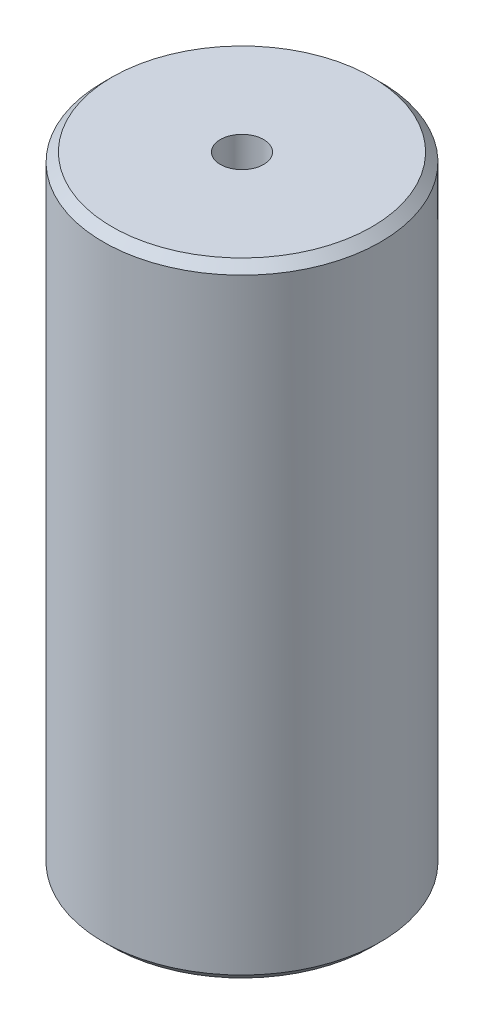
ISO-10303-21;
HEADER;
FILE_DESCRIPTION(('STEP AP214'),'2;1');
FILE_NAME('part.step','',(''),(''),'','','');
FILE_SCHEMA(('AUTOMOTIVE_DESIGN { 1 0 10303 214 1 1 1 1 }'));
ENDSEC;
DATA;
#1=APPLICATION_CONTEXT('core data for automotive mechanical design processes');
#2=APPLICATION_PROTOCOL_DEFINITION('international standard','automotive_design',2000,#1);
#3=PRODUCT_CONTEXT('',#1,'mechanical');
#4=PRODUCT('Part','Part','',(#3));
#5=PRODUCT_RELATED_PRODUCT_CATEGORY('part','',(#4));
#6=PRODUCT_DEFINITION_FORMATION('','',#4);
#7=PRODUCT_DEFINITION_CONTEXT('part definition',#1,'design');
#8=PRODUCT_DEFINITION('design','',#6,#7);
#9=PRODUCT_DEFINITION_SHAPE('','',#8);
#10=(LENGTH_UNIT() NAMED_UNIT(*) SI_UNIT(.MILLI.,.METRE.));
#11=(NAMED_UNIT(*) PLANE_ANGLE_UNIT() SI_UNIT($,.RADIAN.));
#12=(NAMED_UNIT(*) SI_UNIT($,.STERADIAN.) SOLID_ANGLE_UNIT());
#13=UNCERTAINTY_MEASURE_WITH_UNIT(LENGTH_MEASURE(1.E-05),#10,'distance_accuracy_value','');
#14=(GEOMETRIC_REPRESENTATION_CONTEXT(3) GLOBAL_UNCERTAINTY_ASSIGNED_CONTEXT((#13)) GLOBAL_UNIT_ASSIGNED_CONTEXT((#10,
#11,#12)) REPRESENTATION_CONTEXT('',''));
#15=CARTESIAN_POINT('',(0.,0.,0.));
#16=DIRECTION('',(0.,0.,1.));
#17=DIRECTION('',(1.,0.,0.));
#18=AXIS2_PLACEMENT_3D('',#15,#16,#17);
#19=CARTESIAN_POINT('',(0.,114.3,0.));
#20=DIRECTION('',(0.,-1.,0.));
#21=DIRECTION('',(1.,0.,0.));
#22=AXIS2_PLACEMENT_3D('',#19,#20,#21);
#23=PLANE('',#22);
#24=CARTESIAN_POINT('',(0.,114.3,0.));
#25=DIRECTION('',(0.,1.,0.));
#26=DIRECTION('',(0.,0.,1.));
#27=AXIS2_PLACEMENT_3D('',#24,#25,#26);
#28=CIRCLE('',#27,3.96874999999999);
#29=CARTESIAN_POINT('',(0.,114.3,3.96874999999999));
#30=VERTEX_POINT('',#29);
#31=EDGE_CURVE('E61',#30,#30,#28,.T.);
#32=ORIENTED_EDGE('',*,*,#31,.F.);
#33=EDGE_LOOP('',(#32));
#34=FACE_BOUND('',#33,.T.);
#35=CARTESIAN_POINT('',(0.,114.3,0.));
#36=DIRECTION('',(0.,-1.,0.));
#37=DIRECTION('',(1.,0.,0.));
#38=AXIS2_PLACEMENT_3D('',#35,#36,#37);
#39=CIRCLE('',#38,23.7998);
#40=CARTESIAN_POINT('',(23.7998,114.3,0.));
#41=VERTEX_POINT('',#40);
#42=EDGE_CURVE('E11',#41,#41,#39,.F.);
#43=ORIENTED_EDGE('',*,*,#42,.T.);
#44=EDGE_LOOP('',(#43));
#45=FACE_BOUND('',#44,.T.);
#46=ADVANCED_FACE('F36',(#34,#45),#23,.F.);
#47=CARTESIAN_POINT('',(0.,114.3,0.));
#48=DIRECTION('',(0.,1.,0.));
#49=DIRECTION('',(-1.,0.,0.));
#50=AXIS2_PLACEMENT_3D('',#47,#48,#49);
#51=CYLINDRICAL_SURFACE('',#50,25.4);
#52=CARTESIAN_POINT('',(0.,1.60019999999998,0.));
#53=DIRECTION('',(0.,1.,0.));
#54=DIRECTION('',(-1.,0.,0.));
#55=AXIS2_PLACEMENT_3D('',#52,#53,#54);
#56=CIRCLE('',#55,25.4);
#57=CARTESIAN_POINT('',(-25.4,1.60019999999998,0.));
#58=VERTEX_POINT('',#57);
#59=EDGE_CURVE('E74',#58,#58,#56,.T.);
#60=ORIENTED_EDGE('',*,*,#59,.T.);
#61=EDGE_LOOP('',(#60));
#62=FACE_BOUND('',#61,.T.);
#63=CARTESIAN_POINT('',(0.,112.6998,0.));
#64=DIRECTION('',(0.,-1.,0.));
#65=DIRECTION('',(1.,0.,0.));
#66=AXIS2_PLACEMENT_3D('',#63,#64,#65);
#67=CIRCLE('',#66,25.4);
#68=CARTESIAN_POINT('',(25.4,112.6998,0.));
#69=VERTEX_POINT('',#68);
#70=EDGE_CURVE('E71',#69,#69,#67,.T.);
#71=ORIENTED_EDGE('',*,*,#70,.T.);
#72=EDGE_LOOP('',(#71));
#73=FACE_BOUND('',#72,.T.);
#74=ADVANCED_FACE('F86',(#62,#73),#51,.T.);
#75=CARTESIAN_POINT('',(0.,0.,0.));
#76=DIRECTION('',(0.,1.,0.));
#77=DIRECTION('',(-1.,0.,0.));
#78=AXIS2_PLACEMENT_3D('',#75,#76,#77);
#79=PLANE('',#78);
#80=CARTESIAN_POINT('',(0.,0.,0.));
#81=DIRECTION('',(0.,-1.,0.));
#82=DIRECTION('',(0.,0.,-1.));
#83=AXIS2_PLACEMENT_3D('',#80,#81,#82);
#84=CIRCLE('',#83,3.96874999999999);
#85=CARTESIAN_POINT('',(0.,0.,-3.96874999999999));
#86=VERTEX_POINT('',#85);
#87=EDGE_CURVE('E60',#86,#86,#84,.T.);
#88=ORIENTED_EDGE('',*,*,#87,.F.);
#89=EDGE_LOOP('',(#88));
#90=FACE_BOUND('',#89,.T.);
#91=CARTESIAN_POINT('',(0.,0.,0.));
#92=DIRECTION('',(0.,1.,0.));
#93=DIRECTION('',(-1.,0.,0.));
#94=AXIS2_PLACEMENT_3D('',#91,#92,#93);
#95=CIRCLE('',#94,23.7998);
#96=CARTESIAN_POINT('',(-23.7998,0.,0.));
#97=VERTEX_POINT('',#96);
#98=EDGE_CURVE('E44',#97,#97,#95,.F.);
#99=ORIENTED_EDGE('',*,*,#98,.T.);
#100=EDGE_LOOP('',(#99));
#101=FACE_BOUND('',#100,.T.);
#102=ADVANCED_FACE('F79',(#90,#101),#79,.F.);
#103=CARTESIAN_POINT('',(0.,1.60019999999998,0.));
#104=DIRECTION('',(0.,1.,0.));
#105=DIRECTION('',(-1.,0.,0.));
#106=AXIS2_PLACEMENT_3D('',#103,#104,#105);
#107=CONICAL_SURFACE('',#106,25.4,0.785398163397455);
#108=ORIENTED_EDGE('',*,*,#98,.F.);
#109=EDGE_LOOP('',(#108));
#110=FACE_BOUND('',#109,.T.);
#111=ORIENTED_EDGE('',*,*,#59,.F.);
#112=EDGE_LOOP('',(#111));
#113=FACE_BOUND('',#112,.T.);
#114=ADVANCED_FACE('F81',(#110,#113),#107,.T.);
#115=CARTESIAN_POINT('',(0.,114.3,0.));
#116=DIRECTION('',(0.,-1.,0.));
#117=DIRECTION('',(1.,0.,0.));
#118=AXIS2_PLACEMENT_3D('',#115,#116,#117);
#119=CONICAL_SURFACE('',#118,23.7998,0.785398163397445);
#120=CARTESIAN_POINT('',(25.4,112.6998,0.));
#121=CARTESIAN_POINT('',(25.38333125,112.71646875,0.));
#122=CARTESIAN_POINT('',(25.3666625,112.7331375,0.));
#123=CARTESIAN_POINT('',(25.333325,112.766475,0.));
#124=CARTESIAN_POINT('',(25.31665625,112.78314375,0.));
#125=CARTESIAN_POINT('',(25.28331875,112.81648125,0.));
#126=CARTESIAN_POINT('',(25.26665,112.83315,0.));
#127=CARTESIAN_POINT('',(25.2333125,112.8664875,0.));
#128=CARTESIAN_POINT('',(25.21664375,112.88315625,0.));
#129=CARTESIAN_POINT('',(25.18330625,112.91649375,0.));
#130=CARTESIAN_POINT('',(25.1666375,112.9331625,0.));
#131=CARTESIAN_POINT('',(25.1333,112.9665,0.));
#132=CARTESIAN_POINT('',(25.11663125,112.98316875,0.));
#133=CARTESIAN_POINT('',(25.08329375,113.01650625,0.));
#134=CARTESIAN_POINT('',(25.066625,113.033175,0.));
#135=CARTESIAN_POINT('',(25.0332875,113.0665125,0.));
#136=CARTESIAN_POINT('',(25.01661875,113.08318125,0.));
#137=CARTESIAN_POINT('',(24.98328125,113.11651875,0.));
#138=CARTESIAN_POINT('',(24.9666125,113.1331875,0.));
#139=CARTESIAN_POINT('',(24.933275,113.166525,0.));
#140=CARTESIAN_POINT('',(24.91660625,113.18319375,0.));
#141=CARTESIAN_POINT('',(24.88326875,113.21653125,0.));
#142=CARTESIAN_POINT('',(24.8666,113.2332,0.));
#143=CARTESIAN_POINT('',(24.8332625,113.2665375,0.));
#144=CARTESIAN_POINT('',(24.81659375,113.28320625,0.));
#145=CARTESIAN_POINT('',(24.78325625,113.31654375,0.));
#146=CARTESIAN_POINT('',(24.7665875,113.3332125,0.));
#147=CARTESIAN_POINT('',(24.73325,113.36655,0.));
#148=CARTESIAN_POINT('',(24.71658125,113.38321875,0.));
#149=CARTESIAN_POINT('',(24.68324375,113.41655625,0.));
#150=CARTESIAN_POINT('',(24.666575,113.433225,0.));
#151=CARTESIAN_POINT('',(24.6332375,113.4665625,0.));
#152=CARTESIAN_POINT('',(24.61656875,113.48323125,0.));
#153=CARTESIAN_POINT('',(24.58323125,113.51656875,0.));
#154=CARTESIAN_POINT('',(24.5665625,113.5332375,0.));
#155=CARTESIAN_POINT('',(24.533225,113.566575,0.));
#156=CARTESIAN_POINT('',(24.51655625,113.58324375,0.));
#157=CARTESIAN_POINT('',(24.48321875,113.61658125,0.));
#158=CARTESIAN_POINT('',(24.46655,113.63325,0.));
#159=CARTESIAN_POINT('',(24.4332125,113.6665875,0.));
#160=CARTESIAN_POINT('',(24.41654375,113.68325625,0.));
#161=CARTESIAN_POINT('',(24.38320625,113.71659375,0.));
#162=CARTESIAN_POINT('',(24.3665375,113.7332625,0.));
#163=CARTESIAN_POINT('',(24.3332,113.7666,0.));
#164=CARTESIAN_POINT('',(24.31653125,113.78326875,0.));
#165=CARTESIAN_POINT('',(24.28319375,113.81660625,0.));
#166=CARTESIAN_POINT('',(24.266525,113.833275,0.));
#167=CARTESIAN_POINT('',(24.2331875,113.8666125,0.));
#168=CARTESIAN_POINT('',(24.21651875,113.88328125,0.));
#169=CARTESIAN_POINT('',(24.18318125,113.91661875,0.));
#170=CARTESIAN_POINT('',(24.1665125,113.9332875,0.));
#171=CARTESIAN_POINT('',(24.133175,113.966625,0.));
#172=CARTESIAN_POINT('',(24.11650625,113.98329375,0.));
#173=CARTESIAN_POINT('',(24.08316875,114.01663125,0.));
#174=CARTESIAN_POINT('',(24.0665,114.0333,0.));
#175=CARTESIAN_POINT('',(24.0331625,114.0666375,0.));
#176=CARTESIAN_POINT('',(24.01649375,114.08330625,0.));
#177=CARTESIAN_POINT('',(23.98315625,114.11664375,0.));
#178=CARTESIAN_POINT('',(23.9664875,114.1333125,0.));
#179=CARTESIAN_POINT('',(23.93315,114.16665,0.));
#180=CARTESIAN_POINT('',(23.91648125,114.18331875,0.));
#181=CARTESIAN_POINT('',(23.88314375,114.21665625,0.));
#182=CARTESIAN_POINT('',(23.866475,114.233325,0.));
#183=CARTESIAN_POINT('',(23.8331375,114.2666625,0.));
#184=CARTESIAN_POINT('',(23.81646875,114.28333125,0.));
#185=CARTESIAN_POINT('',(23.7998,114.3,0.));
#186=B_SPLINE_CURVE_WITH_KNOTS('',3,(#120,#121,#122,#123,#124,#125,#126,#127,#128,#129,#130,
#131,#132,#133,#134,#135,#136,#137,#138,#139,#140,#141,#142,#143,#144,#145,#146,#147,#148,#149,
#150,#151,#152,#153,#154,#155,#156,#157,#158,#159,#160,#161,#162,#163,#164,#165,#166,#167,#168,
#169,#170,#171,#172,#173,#174,#175,#176,#177,#178,#179,#180,#181,#182,#183,#184,#185),
.UNSPECIFIED.,.F.,.F.,(4,2,2,2,2,2,2,2,2,2,2,2,2,2,2,2,2,2,2,2,2,2,2,2,2,2,2,2,2,2,2,2,4),(0.,
0.0707195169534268,0.141439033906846,0.212158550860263,0.28287806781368,0.3535975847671,
0.424317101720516,0.495036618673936,0.565756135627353,0.63647565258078,0.707195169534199,
0.777914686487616,0.848634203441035,0.919353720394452,0.990073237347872,1.06079275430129,
1.13151227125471,1.20223178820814,1.27295130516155,1.34367082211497,1.41439033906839,
1.48510985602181,1.55582937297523,1.62654888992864,1.69726840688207,1.76798792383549,
1.83870744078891,1.90942695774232,1.98014647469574,2.05086599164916,2.12158550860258,
2.192305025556,2.26302454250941),.UNSPECIFIED.);
#187=EDGE_CURVE('BSEAM38',#69,#41,#186,.T.);
#188=ORIENTED_EDGE('',*,*,#70,.F.);
#189=ORIENTED_EDGE('',*,*,#42,.F.);
#190=ORIENTED_EDGE('',*,*,#187,.T.);
#191=ORIENTED_EDGE('',*,*,#187,.F.);
#192=EDGE_LOOP('',(#188,#190,#189,#191));
#193=FACE_BOUND('',#192,.T.);
#194=ADVANCED_FACE('F38',(#193),#119,.T.);
#195=CARTESIAN_POINT('',(0.,20.6375,0.));
#196=DIRECTION('',(0.,-1.,0.));
#197=DIRECTION('',(0.,0.,-1.));
#198=AXIS2_PLACEMENT_3D('',#195,#196,#197);
#199=CONICAL_SURFACE('',#198,3.96874999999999,1.02974425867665);
#200=CARTESIAN_POINT('',(0.,23.0221655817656,0.));
#201=VERTEX_POINT('',#200);
#202=VERTEX_LOOP('',#201);
#203=FACE_BOUND('',#202,.T.);
#204=CARTESIAN_POINT('',(0.,20.6375,0.));
#205=DIRECTION('',(0.,-1.,0.));
#206=DIRECTION('',(0.,0.,-1.));
#207=AXIS2_PLACEMENT_3D('',#204,#205,#206);
#208=CIRCLE('',#207,3.96874999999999);
#209=CARTESIAN_POINT('',(0.,20.6375,-3.96874999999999));
#210=VERTEX_POINT('',#209);
#211=EDGE_CURVE('E64',#210,#210,#208,.T.);
#212=ORIENTED_EDGE('',*,*,#211,.T.);
#213=EDGE_LOOP('',(#212));
#214=FACE_BOUND('',#213,.T.);
#215=ADVANCED_FACE('F94',(#203,#214),#199,.F.);
#216=CARTESIAN_POINT('',(0.,0.,0.));
#217=DIRECTION('',(0.,-1.,0.));
#218=DIRECTION('',(0.,0.,-1.));
#219=AXIS2_PLACEMENT_3D('',#216,#217,#218);
#220=CYLINDRICAL_SURFACE('',#219,3.96874999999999);
#221=ORIENTED_EDGE('',*,*,#211,.F.);
#222=EDGE_LOOP('',(#221));
#223=FACE_BOUND('',#222,.T.);
#224=ORIENTED_EDGE('',*,*,#87,.T.);
#225=EDGE_LOOP('',(#224));
#226=FACE_BOUND('',#225,.T.);
#227=ADVANCED_FACE('F54',(#223,#226),#220,.F.);
#228=CARTESIAN_POINT('',(0.,93.6625,0.));
#229=DIRECTION('',(0.,1.,0.));
#230=DIRECTION('',(0.,0.,1.));
#231=AXIS2_PLACEMENT_3D('',#228,#229,#230);
#232=CONICAL_SURFACE('',#231,3.96874999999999,1.02974425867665);
#233=CARTESIAN_POINT('',(0.,91.2778344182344,0.));
#234=VERTEX_POINT('',#233);
#235=VERTEX_LOOP('',#234);
#236=FACE_BOUND('',#235,.T.);
#237=CARTESIAN_POINT('',(0.,93.6625,0.));
#238=DIRECTION('',(0.,1.,0.));
#239=DIRECTION('',(0.,0.,1.));
#240=AXIS2_PLACEMENT_3D('',#237,#238,#239);
#241=CIRCLE('',#240,3.96874999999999);
#242=CARTESIAN_POINT('',(0.,93.6625,3.96874999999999));
#243=VERTEX_POINT('',#242);
#244=EDGE_CURVE('E58',#243,#243,#241,.T.);
#245=ORIENTED_EDGE('',*,*,#244,.T.);
#246=EDGE_LOOP('',(#245));
#247=FACE_BOUND('',#246,.T.);
#248=ADVANCED_FACE('F50',(#236,#247),#232,.F.);
#249=CARTESIAN_POINT('',(0.,114.3,0.));
#250=DIRECTION('',(0.,1.,0.));
#251=DIRECTION('',(0.,0.,1.));
#252=AXIS2_PLACEMENT_3D('',#249,#250,#251);
#253=CYLINDRICAL_SURFACE('',#252,3.96874999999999);
#254=ORIENTED_EDGE('',*,*,#244,.F.);
#255=EDGE_LOOP('',(#254));
#256=FACE_BOUND('',#255,.T.);
#257=ORIENTED_EDGE('',*,*,#31,.T.);
#258=EDGE_LOOP('',(#257));
#259=FACE_BOUND('',#258,.T.);
#260=ADVANCED_FACE('F53',(#256,#259),#253,.F.);
#261=CLOSED_SHELL('',(#46,#74,#102,#114,#194,#215,#227,#248,#260));
#262=MANIFOLD_SOLID_BREP('B2',#261);
#263=ADVANCED_BREP_SHAPE_REPRESENTATION('',(#18,#262),#14);
#264=SHAPE_DEFINITION_REPRESENTATION(#9,#263);
ENDSEC;
END-ISO-10303-21;
